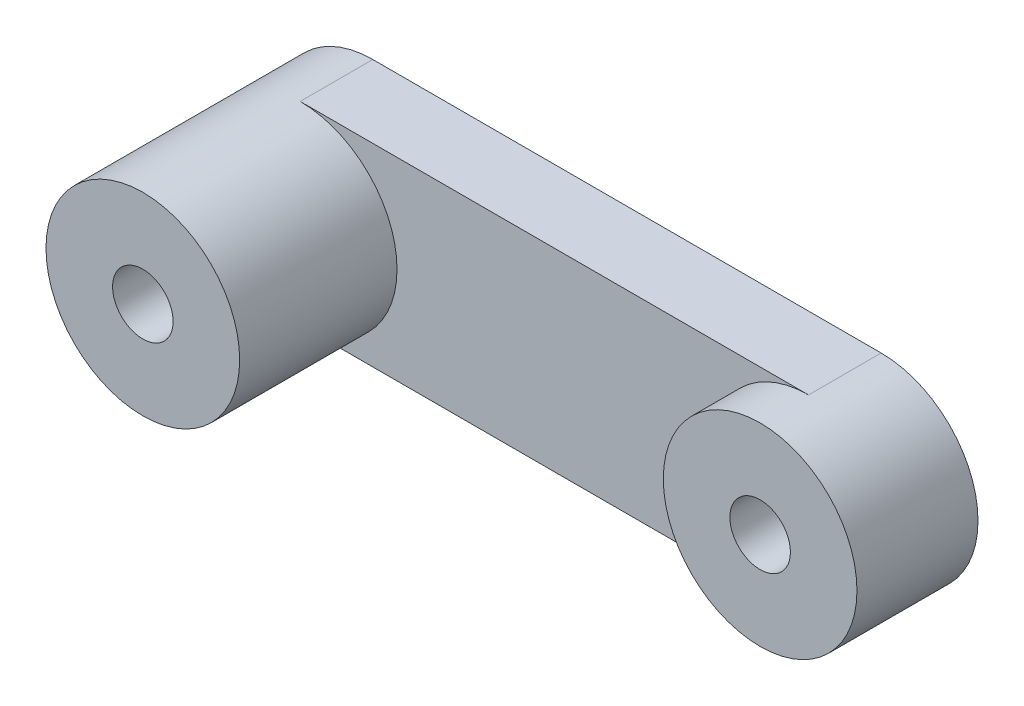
ISO-10303-21;
HEADER;
FILE_DESCRIPTION(('STEP AP214'),'2;1');
FILE_NAME('part.step','',(''),(''),'','','');
FILE_SCHEMA(('AUTOMOTIVE_DESIGN { 1 0 10303 214 1 1 1 1 }'));
ENDSEC;
DATA;
#1=APPLICATION_CONTEXT('core data for automotive mechanical design processes');
#2=APPLICATION_PROTOCOL_DEFINITION('international standard','automotive_design',2000,#1);
#3=PRODUCT_CONTEXT('',#1,'mechanical');
#4=PRODUCT('Part','Part','',(#3));
#5=PRODUCT_RELATED_PRODUCT_CATEGORY('part','',(#4));
#6=PRODUCT_DEFINITION_FORMATION('','',#4);
#7=PRODUCT_DEFINITION_CONTEXT('part definition',#1,'design');
#8=PRODUCT_DEFINITION('design','',#6,#7);
#9=PRODUCT_DEFINITION_SHAPE('','',#8);
#10=(LENGTH_UNIT() NAMED_UNIT(*) SI_UNIT(.MILLI.,.METRE.));
#11=(NAMED_UNIT(*) PLANE_ANGLE_UNIT() SI_UNIT($,.RADIAN.));
#12=(NAMED_UNIT(*) SI_UNIT($,.STERADIAN.) SOLID_ANGLE_UNIT());
#13=UNCERTAINTY_MEASURE_WITH_UNIT(LENGTH_MEASURE(1.E-05),#10,'distance_accuracy_value','');
#14=(GEOMETRIC_REPRESENTATION_CONTEXT(3) GLOBAL_UNCERTAINTY_ASSIGNED_CONTEXT((#13)) GLOBAL_UNIT_ASSIGNED_CONTEXT((#10,
#11,#12)) REPRESENTATION_CONTEXT('',''));
#15=CARTESIAN_POINT('',(0.,0.,0.));
#16=DIRECTION('',(0.,0.,1.));
#17=DIRECTION('',(1.,0.,0.));
#18=AXIS2_PLACEMENT_3D('',#15,#16,#17);
#19=CARTESIAN_POINT('',(10.5,0.,3.));
#20=DIRECTION('',(0.,0.,1.));
#21=DIRECTION('',(1.,0.,0.));
#22=AXIS2_PLACEMENT_3D('',#19,#20,#21);
#23=PLANE('',#22);
#24=CARTESIAN_POINT('',(0.,0.,3.));
#25=DIRECTION('',(0.,0.,1.));
#26=DIRECTION('',(1.,0.,0.));
#27=AXIS2_PLACEMENT_3D('',#24,#25,#26);
#28=CIRCLE('',#27,4.);
#29=CARTESIAN_POINT('',(0.,-4.,3.));
#30=VERTEX_POINT('',#29);
#31=CARTESIAN_POINT('',(0.,4.,3.));
#32=VERTEX_POINT('',#31);
#33=EDGE_CURVE('E83',#30,#32,#28,.T.);
#34=ORIENTED_EDGE('',*,*,#33,.F.);
#35=DIRECTION('',(1.,0.,0.));
#36=VECTOR('',#35,1.);
#37=CARTESIAN_POINT('',(21.,-4.,3.));
#38=LINE('',#37,#36);
#39=CARTESIAN_POINT('',(21.,-4.,3.));
#40=VERTEX_POINT('',#39);
#41=EDGE_CURVE('E68',#40,#30,#38,.F.);
#42=ORIENTED_EDGE('',*,*,#41,.F.);
#43=CARTESIAN_POINT('',(21.,0.,3.));
#44=DIRECTION('',(0.,0.,1.));
#45=DIRECTION('',(1.,0.,0.));
#46=AXIS2_PLACEMENT_3D('',#43,#44,#45);
#47=CIRCLE('',#46,4.);
#48=CARTESIAN_POINT('',(21.,4.,3.));
#49=VERTEX_POINT('',#48);
#50=EDGE_CURVE('E64',#49,#40,#47,.T.);
#51=ORIENTED_EDGE('',*,*,#50,.F.);
#52=DIRECTION('',(1.,0.,0.));
#53=VECTOR('',#52,1.);
#54=CARTESIAN_POINT('',(0.,4.,3.));
#55=LINE('',#54,#53);
#56=EDGE_CURVE('E53',#32,#49,#55,.T.);
#57=ORIENTED_EDGE('',*,*,#56,.F.);
#58=EDGE_LOOP('',(#34,#42,#51,#57));
#59=FACE_BOUND('',#58,.T.);
#60=ADVANCED_FACE('F15',(#59),#23,.T.);
#61=CARTESIAN_POINT('',(21.3636363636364,0.,5.));
#62=DIRECTION('',(0.,0.,1.));
#63=DIRECTION('',(1.,0.,0.));
#64=AXIS2_PLACEMENT_3D('',#61,#62,#63);
#65=PLANE('',#64);
#66=CARTESIAN_POINT('',(21.,0.,5.));
#67=DIRECTION('',(0.,0.,1.));
#68=DIRECTION('',(1.,0.,0.));
#69=AXIS2_PLACEMENT_3D('',#66,#67,#68);
#70=CIRCLE('',#69,1.25);
#71=CARTESIAN_POINT('',(22.25,0.,5.));
#72=VERTEX_POINT('',#71);
#73=EDGE_CURVE('E96',#72,#72,#70,.F.);
#74=ORIENTED_EDGE('',*,*,#73,.T.);
#75=EDGE_LOOP('',(#74));
#76=FACE_BOUND('',#75,.T.);
#77=CARTESIAN_POINT('',(21.,0.,5.));
#78=DIRECTION('',(0.,0.,1.));
#79=DIRECTION('',(1.,0.,0.));
#80=AXIS2_PLACEMENT_3D('',#77,#78,#79);
#81=CIRCLE('',#80,4.);
#82=CARTESIAN_POINT('',(25.,0.,5.));
#83=VERTEX_POINT('',#82);
#84=EDGE_CURVE('E19',#83,#83,#81,.F.);
#85=ORIENTED_EDGE('',*,*,#84,.F.);
#86=EDGE_LOOP('',(#85));
#87=FACE_BOUND('',#86,.T.);
#88=ADVANCED_FACE('F133',(#76,#87),#65,.T.);
#89=CARTESIAN_POINT('',(0.363636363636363,0.,9.5));
#90=DIRECTION('',(0.,0.,1.));
#91=DIRECTION('',(1.,0.,0.));
#92=AXIS2_PLACEMENT_3D('',#89,#90,#91);
#93=PLANE('',#92);
#94=CARTESIAN_POINT('',(0.,0.,9.5));
#95=DIRECTION('',(0.,0.,1.));
#96=DIRECTION('',(1.,0.,0.));
#97=AXIS2_PLACEMENT_3D('',#94,#95,#96);
#98=CIRCLE('',#97,1.25);
#99=CARTESIAN_POINT('',(1.25,0.,9.5));
#100=VERTEX_POINT('',#99);
#101=EDGE_CURVE('E93',#100,#100,#98,.F.);
#102=ORIENTED_EDGE('',*,*,#101,.T.);
#103=EDGE_LOOP('',(#102));
#104=FACE_BOUND('',#103,.T.);
#105=CARTESIAN_POINT('',(0.,0.,9.5));
#106=DIRECTION('',(0.,0.,1.));
#107=DIRECTION('',(1.,0.,0.));
#108=AXIS2_PLACEMENT_3D('',#105,#106,#107);
#109=CIRCLE('',#108,4.);
#110=CARTESIAN_POINT('',(4.,0.,9.5));
#111=VERTEX_POINT('',#110);
#112=EDGE_CURVE('E76',#111,#111,#109,.F.);
#113=ORIENTED_EDGE('',*,*,#112,.F.);
#114=EDGE_LOOP('',(#113));
#115=FACE_BOUND('',#114,.T.);
#116=ADVANCED_FACE('F136',(#104,#115),#93,.T.);
#117=CARTESIAN_POINT('',(21.,0.,0.));
#118=DIRECTION('',(0.,0.,1.));
#119=DIRECTION('',(1.,0.,0.));
#120=AXIS2_PLACEMENT_3D('',#117,#118,#119);
#121=CYLINDRICAL_SURFACE('',#120,4.);
#122=CARTESIAN_POINT('',(21.,0.,0.));
#123=DIRECTION('',(0.,0.,1.));
#124=DIRECTION('',(1.,0.,0.));
#125=AXIS2_PLACEMENT_3D('',#122,#123,#124);
#126=CIRCLE('',#125,4.);
#127=CARTESIAN_POINT('',(21.,-4.,0.));
#128=VERTEX_POINT('',#127);
#129=CARTESIAN_POINT('',(21.,4.,0.));
#130=VERTEX_POINT('',#129);
#131=EDGE_CURVE('E75',#128,#130,#126,.T.);
#132=ORIENTED_EDGE('',*,*,#131,.T.);
#133=DIRECTION('',(0.,0.,1.));
#134=VECTOR('',#133,1.);
#135=CARTESIAN_POINT('',(21.,4.,0.));
#136=LINE('',#135,#134);
#137=EDGE_CURVE('E58',#49,#130,#136,.F.);
#138=ORIENTED_EDGE('',*,*,#137,.F.);
#139=ORIENTED_EDGE('',*,*,#50,.T.);
#140=DIRECTION('',(0.,0.,-1.));
#141=VECTOR('',#140,1.);
#142=CARTESIAN_POINT('',(21.,-4.,0.));
#143=LINE('',#142,#141);
#144=EDGE_CURVE('E99',#128,#40,#143,.F.);
#145=ORIENTED_EDGE('',*,*,#144,.F.);
#146=EDGE_LOOP('',(#132,#138,#139,#145));
#147=FACE_BOUND('',#146,.T.);
#148=ORIENTED_EDGE('',*,*,#84,.T.);
#149=EDGE_LOOP('',(#148));
#150=FACE_BOUND('',#149,.T.);
#151=ADVANCED_FACE('F73',(#147,#150),#121,.T.);
#152=CARTESIAN_POINT('',(0.,4.,0.));
#153=DIRECTION('',(0.,1.,0.));
#154=DIRECTION('',(0.,0.,1.));
#155=AXIS2_PLACEMENT_3D('',#152,#153,#154);
#156=PLANE('',#155);
#157=DIRECTION('',(1.,0.,0.));
#158=VECTOR('',#157,1.);
#159=CARTESIAN_POINT('',(10.5,4.,0.));
#160=LINE('',#159,#158);
#161=CARTESIAN_POINT('',(0.,4.,0.));
#162=VERTEX_POINT('',#161);
#163=EDGE_CURVE('E91',#130,#162,#160,.F.);
#164=ORIENTED_EDGE('',*,*,#163,.T.);
#165=DIRECTION('',(0.,0.,1.));
#166=VECTOR('',#165,1.);
#167=CARTESIAN_POINT('',(0.,4.,0.));
#168=LINE('',#167,#166);
#169=EDGE_CURVE('E60',#32,#162,#168,.F.);
#170=ORIENTED_EDGE('',*,*,#169,.F.);
#171=ORIENTED_EDGE('',*,*,#56,.T.);
#172=ORIENTED_EDGE('',*,*,#137,.T.);
#173=EDGE_LOOP('',(#164,#170,#171,#172));
#174=FACE_BOUND('',#173,.T.);
#175=ADVANCED_FACE('F56',(#174),#156,.T.);
#176=CARTESIAN_POINT('',(0.,0.,0.));
#177=DIRECTION('',(0.,0.,1.));
#178=DIRECTION('',(1.,0.,0.));
#179=AXIS2_PLACEMENT_3D('',#176,#177,#178);
#180=CYLINDRICAL_SURFACE('',#179,4.);
#181=DIRECTION('',(0.,0.,-1.));
#182=VECTOR('',#181,1.);
#183=CARTESIAN_POINT('',(0.,-4.,0.));
#184=LINE('',#183,#182);
#185=CARTESIAN_POINT('',(0.,-4.,0.));
#186=VERTEX_POINT('',#185);
#187=EDGE_CURVE('E34',#30,#186,#184,.T.);
#188=ORIENTED_EDGE('',*,*,#187,.F.);
#189=ORIENTED_EDGE('',*,*,#33,.T.);
#190=ORIENTED_EDGE('',*,*,#169,.T.);
#191=CARTESIAN_POINT('',(0.,0.,0.));
#192=DIRECTION('',(0.,0.,1.));
#193=DIRECTION('',(1.,0.,0.));
#194=AXIS2_PLACEMENT_3D('',#191,#192,#193);
#195=CIRCLE('',#194,4.);
#196=EDGE_CURVE('E88',#162,#186,#195,.T.);
#197=ORIENTED_EDGE('',*,*,#196,.T.);
#198=EDGE_LOOP('',(#188,#189,#190,#197));
#199=FACE_BOUND('',#198,.T.);
#200=ORIENTED_EDGE('',*,*,#112,.T.);
#201=EDGE_LOOP('',(#200));
#202=FACE_BOUND('',#201,.T.);
#203=ADVANCED_FACE('F102',(#199,#202),#180,.T.);
#204=CARTESIAN_POINT('',(21.,-4.,0.));
#205=DIRECTION('',(0.,-1.,0.));
#206=DIRECTION('',(0.,0.,-1.));
#207=AXIS2_PLACEMENT_3D('',#204,#205,#206);
#208=PLANE('',#207);
#209=DIRECTION('',(1.,0.,0.));
#210=VECTOR('',#209,1.);
#211=CARTESIAN_POINT('',(10.5,-4.,0.));
#212=LINE('',#211,#210);
#213=EDGE_CURVE('E87',#186,#128,#212,.T.);
#214=ORIENTED_EDGE('',*,*,#213,.T.);
#215=ORIENTED_EDGE('',*,*,#144,.T.);
#216=ORIENTED_EDGE('',*,*,#41,.T.);
#217=ORIENTED_EDGE('',*,*,#187,.T.);
#218=EDGE_LOOP('',(#214,#215,#216,#217));
#219=FACE_BOUND('',#218,.T.);
#220=ADVANCED_FACE('F108',(#219),#208,.T.);
#221=CARTESIAN_POINT('',(21.,0.,0.));
#222=DIRECTION('',(0.,0.,1.));
#223=DIRECTION('',(1.,0.,0.));
#224=AXIS2_PLACEMENT_3D('',#221,#222,#223);
#225=CYLINDRICAL_SURFACE('',#224,1.25);
#226=CARTESIAN_POINT('',(21.,0.,0.));
#227=DIRECTION('',(0.,0.,1.));
#228=DIRECTION('',(1.,0.,0.));
#229=AXIS2_PLACEMENT_3D('',#226,#227,#228);
#230=CIRCLE('',#229,1.25);
#231=CARTESIAN_POINT('',(22.25,0.,0.));
#232=VERTEX_POINT('',#231);
#233=EDGE_CURVE('E25',#232,#232,#230,.F.);
#234=ORIENTED_EDGE('',*,*,#233,.T.);
#235=EDGE_LOOP('',(#234));
#236=FACE_BOUND('',#235,.T.);
#237=ORIENTED_EDGE('',*,*,#73,.F.);
#238=EDGE_LOOP('',(#237));
#239=FACE_BOUND('',#238,.T.);
#240=ADVANCED_FACE('F110',(#236,#239),#225,.F.);
#241=CARTESIAN_POINT('',(0.,0.,0.));
#242=DIRECTION('',(0.,0.,1.));
#243=DIRECTION('',(1.,0.,0.));
#244=AXIS2_PLACEMENT_3D('',#241,#242,#243);
#245=CYLINDRICAL_SURFACE('',#244,1.25);
#246=CARTESIAN_POINT('',(0.,0.,0.));
#247=DIRECTION('',(0.,0.,1.));
#248=DIRECTION('',(1.,0.,0.));
#249=AXIS2_PLACEMENT_3D('',#246,#247,#248);
#250=CIRCLE('',#249,1.25);
#251=CARTESIAN_POINT('',(1.25,0.,0.));
#252=VERTEX_POINT('',#251);
#253=EDGE_CURVE('E10',#252,#252,#250,.F.);
#254=ORIENTED_EDGE('',*,*,#253,.T.);
#255=EDGE_LOOP('',(#254));
#256=FACE_BOUND('',#255,.T.);
#257=ORIENTED_EDGE('',*,*,#101,.F.);
#258=EDGE_LOOP('',(#257));
#259=FACE_BOUND('',#258,.T.);
#260=ADVANCED_FACE('F117',(#256,#259),#245,.F.);
#261=CARTESIAN_POINT('',(10.5,0.,0.));
#262=DIRECTION('',(0.,0.,1.));
#263=DIRECTION('',(1.,0.,0.));
#264=AXIS2_PLACEMENT_3D('',#261,#262,#263);
#265=PLANE('',#264);
#266=ORIENTED_EDGE('',*,*,#253,.F.);
#267=EDGE_LOOP('',(#266));
#268=FACE_BOUND('',#267,.T.);
#269=ORIENTED_EDGE('',*,*,#233,.F.);
#270=EDGE_LOOP('',(#269));
#271=FACE_BOUND('',#270,.T.);
#272=ORIENTED_EDGE('',*,*,#196,.F.);
#273=ORIENTED_EDGE('',*,*,#163,.F.);
#274=ORIENTED_EDGE('',*,*,#131,.F.);
#275=ORIENTED_EDGE('',*,*,#213,.F.);
#276=EDGE_LOOP('',(#272,#273,#274,#275));
#277=FACE_BOUND('',#276,.T.);
#278=ADVANCED_FACE('F17',(#268,#271,#277),#265,.F.);
#279=CLOSED_SHELL('',(#60,#88,#116,#151,#175,#203,#220,#240,#260,#278));
#280=MANIFOLD_SOLID_BREP('B1',#279);
#281=ADVANCED_BREP_SHAPE_REPRESENTATION('',(#18,#280),#14);
#282=SHAPE_DEFINITION_REPRESENTATION(#9,#281);
ENDSEC;
END-ISO-10303-21;
